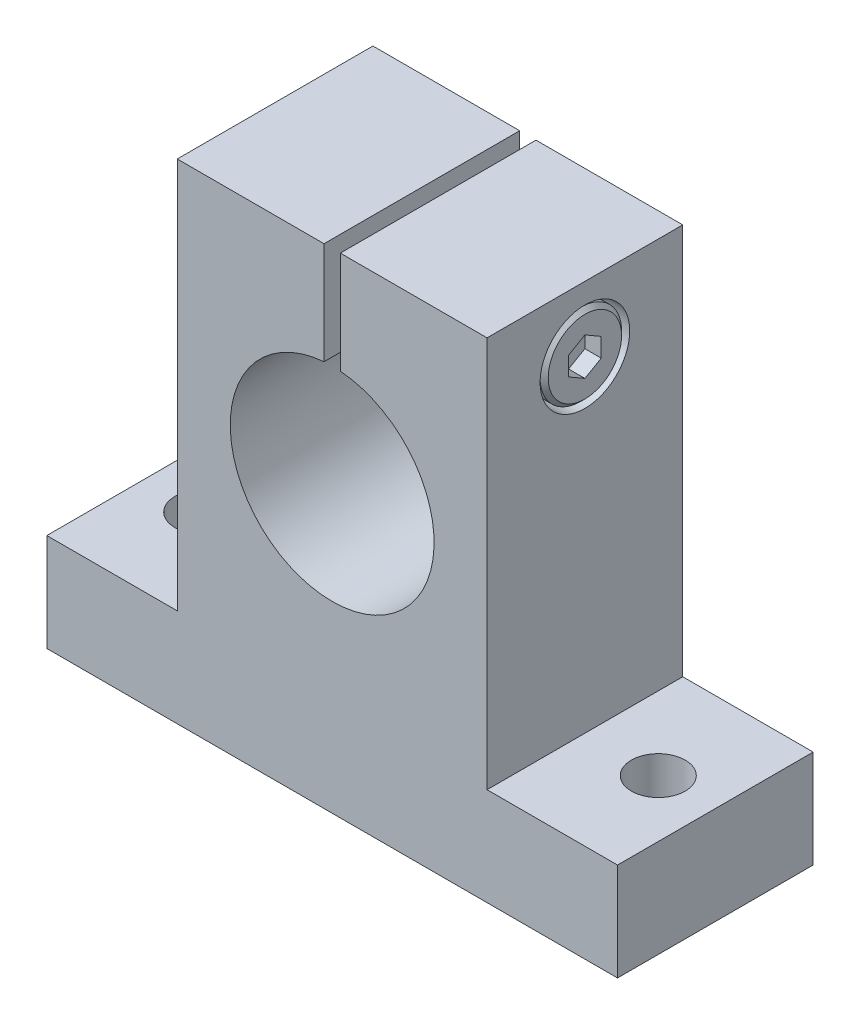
ISO-10303-21;
HEADER;
FILE_DESCRIPTION(('STEP AP214'),'2;1');
FILE_NAME('part.step','',(''),(''),'','','');
FILE_SCHEMA(('AUTOMOTIVE_DESIGN { 1 0 10303 214 1 1 1 1 }'));
ENDSEC;
DATA;
#1=APPLICATION_CONTEXT('core data for automotive mechanical design processes');
#2=APPLICATION_PROTOCOL_DEFINITION('international standard','automotive_design',2000,#1);
#3=PRODUCT_CONTEXT('',#1,'mechanical');
#4=PRODUCT('Part','Part','',(#3));
#5=PRODUCT_RELATED_PRODUCT_CATEGORY('part','',(#4));
#6=PRODUCT_DEFINITION_FORMATION('','',#4);
#7=PRODUCT_DEFINITION_CONTEXT('part definition',#1,'design');
#8=PRODUCT_DEFINITION('design','',#6,#7);
#9=PRODUCT_DEFINITION_SHAPE('','',#8);
#10=(LENGTH_UNIT() NAMED_UNIT(*) SI_UNIT(.MILLI.,.METRE.));
#11=(NAMED_UNIT(*) PLANE_ANGLE_UNIT() SI_UNIT($,.RADIAN.));
#12=(NAMED_UNIT(*) SI_UNIT($,.STERADIAN.) SOLID_ANGLE_UNIT());
#13=UNCERTAINTY_MEASURE_WITH_UNIT(LENGTH_MEASURE(1.E-05),#10,'distance_accuracy_value','');
#14=(GEOMETRIC_REPRESENTATION_CONTEXT(3) GLOBAL_UNCERTAINTY_ASSIGNED_CONTEXT((#13)) GLOBAL_UNIT_ASSIGNED_CONTEXT((#10,
#11,#12)) REPRESENTATION_CONTEXT('',''));
#15=CARTESIAN_POINT('',(0.,0.,0.));
#16=DIRECTION('',(0.,0.,1.));
#17=DIRECTION('',(1.,0.,0.));
#18=AXIS2_PLACEMENT_3D('',#15,#16,#17);
#19=CARTESIAN_POINT('',(0.,0.,-24.));
#20=DIRECTION('',(0.,0.,1.));
#21=DIRECTION('',(1.,0.,0.));
#22=AXIS2_PLACEMENT_3D('',#19,#20,#21);
#23=PLANE('',#22);
#24=DIRECTION('',(0.,1.,0.));
#25=VECTOR('',#24,1.);
#26=CARTESIAN_POINT('',(1.,0.,-24.));
#27=LINE('',#26,#25);
#28=CARTESIAN_POINT('',(1.,12.4599357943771,-24.));
#29=VERTEX_POINT('',#28);
#30=CARTESIAN_POINT('',(1.,25.,-24.));
#31=VERTEX_POINT('',#30);
#32=EDGE_CURVE('E315',#29,#31,#27,.T.);
#33=ORIENTED_EDGE('',*,*,#32,.T.);
#34=DIRECTION('',(-1.,0.,0.));
#35=VECTOR('',#34,1.);
#36=CARTESIAN_POINT('',(19.,25.,-24.));
#37=LINE('',#36,#35);
#38=CARTESIAN_POINT('',(19.,25.,-24.));
#39=VERTEX_POINT('',#38);
#40=EDGE_CURVE('E398',#39,#31,#37,.T.);
#41=ORIENTED_EDGE('',*,*,#40,.F.);
#42=DIRECTION('',(0.,1.,0.));
#43=VECTOR('',#42,1.);
#44=CARTESIAN_POINT('',(19.,-23.,-24.));
#45=LINE('',#44,#43);
#46=CARTESIAN_POINT('',(19.,-23.,-24.));
#47=VERTEX_POINT('',#46);
#48=EDGE_CURVE('E388',#47,#39,#45,.T.);
#49=ORIENTED_EDGE('',*,*,#48,.F.);
#50=DIRECTION('',(-1.,0.,0.));
#51=VECTOR('',#50,1.);
#52=CARTESIAN_POINT('',(35.,-23.,-24.));
#53=LINE('',#52,#51);
#54=CARTESIAN_POINT('',(35.,-23.,-24.));
#55=VERTEX_POINT('',#54);
#56=EDGE_CURVE('E380',#55,#47,#53,.T.);
#57=ORIENTED_EDGE('',*,*,#56,.F.);
#58=DIRECTION('',(0.,1.,0.));
#59=VECTOR('',#58,1.);
#60=CARTESIAN_POINT('',(35.,-35.,-24.));
#61=LINE('',#60,#59);
#62=CARTESIAN_POINT('',(35.,-35.,-24.));
#63=VERTEX_POINT('',#62);
#64=EDGE_CURVE('E368',#63,#55,#61,.T.);
#65=ORIENTED_EDGE('',*,*,#64,.F.);
#66=DIRECTION('',(1.,0.,0.));
#67=VECTOR('',#66,1.);
#68=CARTESIAN_POINT('',(-35.,-35.,-24.));
#69=LINE('',#68,#67);
#70=CARTESIAN_POINT('',(-35.,-35.,-24.));
#71=VERTEX_POINT('',#70);
#72=EDGE_CURVE('E10',#71,#63,#69,.T.);
#73=ORIENTED_EDGE('',*,*,#72,.F.);
#74=DIRECTION('',(0.,-1.,0.));
#75=VECTOR('',#74,1.);
#76=CARTESIAN_POINT('',(-35.,-23.,-24.));
#77=LINE('',#76,#75);
#78=CARTESIAN_POINT('',(-35.,-23.,-24.));
#79=VERTEX_POINT('',#78);
#80=EDGE_CURVE('E42',#79,#71,#77,.T.);
#81=ORIENTED_EDGE('',*,*,#80,.F.);
#82=DIRECTION('',(-1.,0.,0.));
#83=VECTOR('',#82,1.);
#84=CARTESIAN_POINT('',(-19.,-23.,-24.));
#85=LINE('',#84,#83);
#86=CARTESIAN_POINT('',(-19.,-23.,-24.));
#87=VERTEX_POINT('',#86);
#88=EDGE_CURVE('E348',#87,#79,#85,.T.);
#89=ORIENTED_EDGE('',*,*,#88,.F.);
#90=DIRECTION('',(0.,-1.,0.));
#91=VECTOR('',#90,1.);
#92=CARTESIAN_POINT('',(-19.,25.,-24.));
#93=LINE('',#92,#91);
#94=CARTESIAN_POINT('',(-19.,25.,-24.));
#95=VERTEX_POINT('',#94);
#96=EDGE_CURVE('E401',#95,#87,#93,.T.);
#97=ORIENTED_EDGE('',*,*,#96,.F.);
#98=DIRECTION('',(-1.,0.,0.));
#99=VECTOR('',#98,1.);
#100=CARTESIAN_POINT('',(19.,25.,-24.));
#101=LINE('',#100,#99);
#102=CARTESIAN_POINT('',(-1.,25.,-24.));
#103=VERTEX_POINT('',#102);
#104=EDGE_CURVE('E358',#103,#95,#101,.T.);
#105=ORIENTED_EDGE('',*,*,#104,.F.);
#106=DIRECTION('',(0.,-1.,0.));
#107=VECTOR('',#106,1.);
#108=CARTESIAN_POINT('',(-1.,12.5,-24.));
#109=LINE('',#108,#107);
#110=CARTESIAN_POINT('',(-1.,12.4599357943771,-24.));
#111=VERTEX_POINT('',#110);
#112=EDGE_CURVE('E319',#103,#111,#109,.T.);
#113=ORIENTED_EDGE('',*,*,#112,.T.);
#114=CARTESIAN_POINT('',(0.,0.,-24.));
#115=DIRECTION('',(0.,0.,1.));
#116=DIRECTION('',(1.,0.,0.));
#117=AXIS2_PLACEMENT_3D('',#114,#115,#116);
#118=CIRCLE('',#117,12.5);
#119=EDGE_CURVE('E430',#111,#29,#118,.T.);
#120=ORIENTED_EDGE('',*,*,#119,.T.);
#121=EDGE_LOOP('',(#33,#41,#49,#57,#65,#73,#81,#89,#97,#105,#113,#120));
#122=FACE_BOUND('',#121,.T.);
#123=ADVANCED_FACE('F16',(#122),#23,.F.);
#124=CARTESIAN_POINT('',(-35.,-35.,0.));
#125=DIRECTION('',(0.,-1.,0.));
#126=DIRECTION('',(0.,0.,-1.));
#127=AXIS2_PLACEMENT_3D('',#124,#125,#126);
#128=PLANE('',#127);
#129=CARTESIAN_POINT('',(28.,-35.,-12.));
#130=DIRECTION('',(0.,1.,0.));
#131=DIRECTION('',(0.,0.,-1.));
#132=AXIS2_PLACEMENT_3D('',#129,#130,#131);
#133=CIRCLE('',#132,3.3);
#134=CARTESIAN_POINT('',(28.,-35.,-8.7));
#135=VERTEX_POINT('',#134);
#136=EDGE_CURVE('E479',#135,#135,#133,.T.);
#137=ORIENTED_EDGE('',*,*,#136,.T.);
#138=EDGE_LOOP('',(#137));
#139=FACE_BOUND('',#138,.T.);
#140=CARTESIAN_POINT('',(-28.,-35.,-12.));
#141=DIRECTION('',(0.,1.,0.));
#142=DIRECTION('',(0.,0.,-1.));
#143=AXIS2_PLACEMENT_3D('',#140,#141,#142);
#144=CIRCLE('',#143,3.3);
#145=CARTESIAN_POINT('',(-28.,-35.,-8.7));
#146=VERTEX_POINT('',#145);
#147=EDGE_CURVE('E445',#146,#146,#144,.T.);
#148=ORIENTED_EDGE('',*,*,#147,.T.);
#149=EDGE_LOOP('',(#148));
#150=FACE_BOUND('',#149,.T.);
#151=ORIENTED_EDGE('',*,*,#72,.T.);
#152=DIRECTION('',(0.,0.,-1.));
#153=VECTOR('',#152,1.);
#154=CARTESIAN_POINT('',(35.,-35.,0.));
#155=LINE('',#154,#153);
#156=CARTESIAN_POINT('',(35.,-35.,0.));
#157=VERTEX_POINT('',#156);
#158=EDGE_CURVE('E375',#157,#63,#155,.T.);
#159=ORIENTED_EDGE('',*,*,#158,.F.);
#160=DIRECTION('',(1.,0.,0.));
#161=VECTOR('',#160,1.);
#162=CARTESIAN_POINT('',(-35.,-35.,0.));
#163=LINE('',#162,#161);
#164=CARTESIAN_POINT('',(-35.,-35.,0.));
#165=VERTEX_POINT('',#164);
#166=EDGE_CURVE('E340',#165,#157,#163,.T.);
#167=ORIENTED_EDGE('',*,*,#166,.F.);
#168=DIRECTION('',(0.,0.,-1.));
#169=VECTOR('',#168,1.);
#170=CARTESIAN_POINT('',(-35.,-35.,0.));
#171=LINE('',#170,#169);
#172=EDGE_CURVE('E19',#165,#71,#171,.T.);
#173=ORIENTED_EDGE('',*,*,#172,.T.);
#174=EDGE_LOOP('',(#151,#159,#167,#173));
#175=FACE_BOUND('',#174,.T.);
#176=ADVANCED_FACE('F531',(#139,#150,#175),#128,.T.);
#177=CARTESIAN_POINT('',(-35.,-23.,0.));
#178=DIRECTION('',(-1.,0.,0.));
#179=DIRECTION('',(0.,0.,1.));
#180=AXIS2_PLACEMENT_3D('',#177,#178,#179);
#181=PLANE('',#180);
#182=ORIENTED_EDGE('',*,*,#80,.T.);
#183=ORIENTED_EDGE('',*,*,#172,.F.);
#184=DIRECTION('',(0.,-1.,0.));
#185=VECTOR('',#184,1.);
#186=CARTESIAN_POINT('',(-35.,-23.,0.));
#187=LINE('',#186,#185);
#188=CARTESIAN_POINT('',(-35.,-23.,0.));
#189=VERTEX_POINT('',#188);
#190=EDGE_CURVE('E299',#189,#165,#187,.T.);
#191=ORIENTED_EDGE('',*,*,#190,.F.);
#192=DIRECTION('',(0.,0.,-1.));
#193=VECTOR('',#192,1.);
#194=CARTESIAN_POINT('',(-35.,-23.,0.));
#195=LINE('',#194,#193);
#196=EDGE_CURVE('E345',#189,#79,#195,.T.);
#197=ORIENTED_EDGE('',*,*,#196,.T.);
#198=EDGE_LOOP('',(#182,#183,#191,#197));
#199=FACE_BOUND('',#198,.T.);
#200=ADVANCED_FACE('F535',(#199),#181,.T.);
#201=CARTESIAN_POINT('',(-19.,-23.,0.));
#202=DIRECTION('',(0.,1.,0.));
#203=DIRECTION('',(1.,0.,0.));
#204=AXIS2_PLACEMENT_3D('',#201,#202,#203);
#205=PLANE('',#204);
#206=CARTESIAN_POINT('',(-28.,-23.,-12.));
#207=DIRECTION('',(0.,-1.,0.));
#208=DIRECTION('',(0.,0.,-1.));
#209=AXIS2_PLACEMENT_3D('',#206,#207,#208);
#210=CIRCLE('',#209,3.3);
#211=CARTESIAN_POINT('',(-28.,-23.,-8.7));
#212=VERTEX_POINT('',#211);
#213=EDGE_CURVE('E446',#212,#212,#210,.T.);
#214=ORIENTED_EDGE('',*,*,#213,.T.);
#215=EDGE_LOOP('',(#214));
#216=FACE_BOUND('',#215,.T.);
#217=ORIENTED_EDGE('',*,*,#88,.T.);
#218=ORIENTED_EDGE('',*,*,#196,.F.);
#219=DIRECTION('',(-1.,0.,0.));
#220=VECTOR('',#219,1.);
#221=CARTESIAN_POINT('',(-19.,-23.,0.));
#222=LINE('',#221,#220);
#223=CARTESIAN_POINT('',(-19.,-23.,0.));
#224=VERTEX_POINT('',#223);
#225=EDGE_CURVE('E295',#224,#189,#222,.T.);
#226=ORIENTED_EDGE('',*,*,#225,.F.);
#227=DIRECTION('',(0.,0.,-1.));
#228=VECTOR('',#227,1.);
#229=CARTESIAN_POINT('',(-19.,-23.,0.));
#230=LINE('',#229,#228);
#231=EDGE_CURVE('E405',#224,#87,#230,.T.);
#232=ORIENTED_EDGE('',*,*,#231,.T.);
#233=EDGE_LOOP('',(#217,#218,#226,#232));
#234=FACE_BOUND('',#233,.T.);
#235=ADVANCED_FACE('F413',(#216,#234),#205,.T.);
#236=CARTESIAN_POINT('',(-19.,25.,0.));
#237=DIRECTION('',(-1.,0.,0.));
#238=DIRECTION('',(0.,0.,1.));
#239=AXIS2_PLACEMENT_3D('',#236,#237,#238);
#240=PLANE('',#239);
#241=ORIENTED_EDGE('',*,*,#96,.T.);
#242=ORIENTED_EDGE('',*,*,#231,.F.);
#243=DIRECTION('',(0.,-1.,0.));
#244=VECTOR('',#243,1.);
#245=CARTESIAN_POINT('',(-19.,25.,0.));
#246=LINE('',#245,#244);
#247=CARTESIAN_POINT('',(-19.,25.,0.));
#248=VERTEX_POINT('',#247);
#249=EDGE_CURVE('E300',#248,#224,#246,.T.);
#250=ORIENTED_EDGE('',*,*,#249,.F.);
#251=DIRECTION('',(0.,0.,-1.));
#252=VECTOR('',#251,1.);
#253=CARTESIAN_POINT('',(-19.,25.,0.));
#254=LINE('',#253,#252);
#255=EDGE_CURVE('E362',#248,#95,#254,.T.);
#256=ORIENTED_EDGE('',*,*,#255,.T.);
#257=EDGE_LOOP('',(#241,#242,#250,#256));
#258=FACE_BOUND('',#257,.T.);
#259=ADVANCED_FACE('F418',(#258),#240,.T.);
#260=CARTESIAN_POINT('',(19.,25.,0.));
#261=DIRECTION('',(0.,1.,0.));
#262=DIRECTION('',(1.,0.,0.));
#263=AXIS2_PLACEMENT_3D('',#260,#261,#262);
#264=PLANE('',#263);
#265=DIRECTION('',(0.,0.,1.));
#266=VECTOR('',#265,1.);
#267=CARTESIAN_POINT('',(1.,25.,0.));
#268=LINE('',#267,#266);
#269=CARTESIAN_POINT('',(1.,25.,0.));
#270=VERTEX_POINT('',#269);
#271=EDGE_CURVE('E311',#31,#270,#268,.T.);
#272=ORIENTED_EDGE('',*,*,#271,.T.);
#273=DIRECTION('',(-1.,0.,0.));
#274=VECTOR('',#273,1.);
#275=CARTESIAN_POINT('',(19.,25.,0.));
#276=LINE('',#275,#274);
#277=CARTESIAN_POINT('',(19.,25.,0.));
#278=VERTEX_POINT('',#277);
#279=EDGE_CURVE('E357',#278,#270,#276,.T.);
#280=ORIENTED_EDGE('',*,*,#279,.F.);
#281=DIRECTION('',(0.,0.,-1.));
#282=VECTOR('',#281,1.);
#283=CARTESIAN_POINT('',(19.,25.,0.));
#284=LINE('',#283,#282);
#285=EDGE_CURVE('E392',#278,#39,#284,.T.);
#286=ORIENTED_EDGE('',*,*,#285,.T.);
#287=ORIENTED_EDGE('',*,*,#40,.T.);
#288=EDGE_LOOP('',(#272,#280,#286,#287));
#289=FACE_BOUND('',#288,.T.);
#290=ADVANCED_FACE('F549',(#289),#264,.T.);
#291=CARTESIAN_POINT('',(19.,-23.,0.));
#292=DIRECTION('',(1.,0.,0.));
#293=DIRECTION('',(0.,1.,0.));
#294=AXIS2_PLACEMENT_3D('',#291,#292,#293);
#295=PLANE('',#294);
#296=CARTESIAN_POINT('',(19.,17.,-12.));
#297=DIRECTION('',(-1.,0.,0.));
#298=DIRECTION('',(0.,0.,-1.));
#299=AXIS2_PLACEMENT_3D('',#296,#297,#298);
#300=CIRCLE('',#299,5.5);
#301=CARTESIAN_POINT('',(19.,17.,-6.5));
#302=VERTEX_POINT('',#301);
#303=EDGE_CURVE('E500',#302,#302,#300,.T.);
#304=ORIENTED_EDGE('',*,*,#303,.T.);
#305=EDGE_LOOP('',(#304));
#306=FACE_BOUND('',#305,.T.);
#307=ORIENTED_EDGE('',*,*,#48,.T.);
#308=ORIENTED_EDGE('',*,*,#285,.F.);
#309=DIRECTION('',(0.,1.,0.));
#310=VECTOR('',#309,1.);
#311=CARTESIAN_POINT('',(19.,-23.,0.));
#312=LINE('',#311,#310);
#313=CARTESIAN_POINT('',(19.,-23.,0.));
#314=VERTEX_POINT('',#313);
#315=EDGE_CURVE('E353',#314,#278,#312,.T.);
#316=ORIENTED_EDGE('',*,*,#315,.F.);
#317=DIRECTION('',(0.,0.,-1.));
#318=VECTOR('',#317,1.);
#319=CARTESIAN_POINT('',(19.,-23.,0.));
#320=LINE('',#319,#318);
#321=EDGE_CURVE('E384',#314,#47,#320,.T.);
#322=ORIENTED_EDGE('',*,*,#321,.T.);
#323=EDGE_LOOP('',(#307,#308,#316,#322));
#324=FACE_BOUND('',#323,.T.);
#325=ADVANCED_FACE('F550',(#306,#324),#295,.T.);
#326=CARTESIAN_POINT('',(35.,-23.,0.));
#327=DIRECTION('',(0.,1.,0.));
#328=DIRECTION('',(1.,0.,0.));
#329=AXIS2_PLACEMENT_3D('',#326,#327,#328);
#330=PLANE('',#329);
#331=CARTESIAN_POINT('',(28.,-23.,-12.));
#332=DIRECTION('',(0.,-1.,0.));
#333=DIRECTION('',(0.,0.,-1.));
#334=AXIS2_PLACEMENT_3D('',#331,#332,#333);
#335=CIRCLE('',#334,3.3);
#336=CARTESIAN_POINT('',(28.,-23.,-8.7));
#337=VERTEX_POINT('',#336);
#338=EDGE_CURVE('E468',#337,#337,#335,.T.);
#339=ORIENTED_EDGE('',*,*,#338,.T.);
#340=EDGE_LOOP('',(#339));
#341=FACE_BOUND('',#340,.T.);
#342=ORIENTED_EDGE('',*,*,#56,.T.);
#343=ORIENTED_EDGE('',*,*,#321,.F.);
#344=DIRECTION('',(-1.,0.,0.));
#345=VECTOR('',#344,1.);
#346=CARTESIAN_POINT('',(35.,-23.,0.));
#347=LINE('',#346,#345);
#348=CARTESIAN_POINT('',(35.,-23.,0.));
#349=VERTEX_POINT('',#348);
#350=EDGE_CURVE('E352',#349,#314,#347,.T.);
#351=ORIENTED_EDGE('',*,*,#350,.F.);
#352=DIRECTION('',(0.,0.,-1.));
#353=VECTOR('',#352,1.);
#354=CARTESIAN_POINT('',(35.,-23.,0.));
#355=LINE('',#354,#353);
#356=EDGE_CURVE('E372',#349,#55,#355,.T.);
#357=ORIENTED_EDGE('',*,*,#356,.T.);
#358=EDGE_LOOP('',(#342,#343,#351,#357));
#359=FACE_BOUND('',#358,.T.);
#360=ADVANCED_FACE('F553',(#341,#359),#330,.T.);
#361=CARTESIAN_POINT('',(35.,-35.,0.));
#362=DIRECTION('',(1.,0.,0.));
#363=DIRECTION('',(0.,1.,0.));
#364=AXIS2_PLACEMENT_3D('',#361,#362,#363);
#365=PLANE('',#364);
#366=ORIENTED_EDGE('',*,*,#64,.T.);
#367=ORIENTED_EDGE('',*,*,#356,.F.);
#368=DIRECTION('',(0.,1.,0.));
#369=VECTOR('',#368,1.);
#370=CARTESIAN_POINT('',(35.,-35.,0.));
#371=LINE('',#370,#369);
#372=EDGE_CURVE('E344',#157,#349,#371,.T.);
#373=ORIENTED_EDGE('',*,*,#372,.F.);
#374=ORIENTED_EDGE('',*,*,#158,.T.);
#375=EDGE_LOOP('',(#366,#367,#373,#374));
#376=FACE_BOUND('',#375,.T.);
#377=ADVANCED_FACE('F555',(#376),#365,.T.);
#378=CARTESIAN_POINT('',(19.,25.,0.));
#379=DIRECTION('',(0.,1.,0.));
#380=DIRECTION('',(1.,0.,0.));
#381=AXIS2_PLACEMENT_3D('',#378,#379,#380);
#382=PLANE('',#381);
#383=DIRECTION('',(0.,0.,-1.));
#384=VECTOR('',#383,1.);
#385=CARTESIAN_POINT('',(-1.,25.,0.));
#386=LINE('',#385,#384);
#387=CARTESIAN_POINT('',(-1.,25.,0.));
#388=VERTEX_POINT('',#387);
#389=EDGE_CURVE('E322',#388,#103,#386,.T.);
#390=ORIENTED_EDGE('',*,*,#389,.T.);
#391=ORIENTED_EDGE('',*,*,#104,.T.);
#392=ORIENTED_EDGE('',*,*,#255,.F.);
#393=DIRECTION('',(-1.,0.,0.));
#394=VECTOR('',#393,1.);
#395=CARTESIAN_POINT('',(19.,25.,0.));
#396=LINE('',#395,#394);
#397=EDGE_CURVE('E327',#388,#248,#396,.T.);
#398=ORIENTED_EDGE('',*,*,#397,.F.);
#399=EDGE_LOOP('',(#390,#391,#392,#398));
#400=FACE_BOUND('',#399,.T.);
#401=ADVANCED_FACE('F420',(#400),#382,.T.);
#402=CARTESIAN_POINT('',(0.,0.,0.));
#403=DIRECTION('',(0.,0.,1.));
#404=DIRECTION('',(1.,0.,0.));
#405=AXIS2_PLACEMENT_3D('',#402,#403,#404);
#406=PLANE('',#405);
#407=DIRECTION('',(0.,-1.,0.));
#408=VECTOR('',#407,1.);
#409=CARTESIAN_POINT('',(1.,0.,0.));
#410=LINE('',#409,#408);
#411=CARTESIAN_POINT('',(1.,12.4599357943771,0.));
#412=VERTEX_POINT('',#411);
#413=EDGE_CURVE('E308',#270,#412,#410,.T.);
#414=ORIENTED_EDGE('',*,*,#413,.T.);
#415=CARTESIAN_POINT('',(0.,0.,0.));
#416=DIRECTION('',(0.,0.,-1.));
#417=DIRECTION('',(1.,0.,0.));
#418=AXIS2_PLACEMENT_3D('',#415,#416,#417);
#419=CIRCLE('',#418,12.5);
#420=CARTESIAN_POINT('',(-1.,12.4599357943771,0.));
#421=VERTEX_POINT('',#420);
#422=EDGE_CURVE('E439',#412,#421,#419,.T.);
#423=ORIENTED_EDGE('',*,*,#422,.T.);
#424=DIRECTION('',(0.,1.,0.));
#425=VECTOR('',#424,1.);
#426=CARTESIAN_POINT('',(-1.,12.5,0.));
#427=LINE('',#426,#425);
#428=EDGE_CURVE('E323',#421,#388,#427,.T.);
#429=ORIENTED_EDGE('',*,*,#428,.T.);
#430=ORIENTED_EDGE('',*,*,#397,.T.);
#431=ORIENTED_EDGE('',*,*,#249,.T.);
#432=ORIENTED_EDGE('',*,*,#225,.T.);
#433=ORIENTED_EDGE('',*,*,#190,.T.);
#434=ORIENTED_EDGE('',*,*,#166,.T.);
#435=ORIENTED_EDGE('',*,*,#372,.T.);
#436=ORIENTED_EDGE('',*,*,#350,.T.);
#437=ORIENTED_EDGE('',*,*,#315,.T.);
#438=ORIENTED_EDGE('',*,*,#279,.T.);
#439=EDGE_LOOP('',(#414,#423,#429,#430,#431,#432,#433,#434,#435,#436,#437,#438));
#440=FACE_BOUND('',#439,.T.);
#441=ADVANCED_FACE('F561',(#440),#406,.T.);
#442=CARTESIAN_POINT('',(-1.,25.,0.));
#443=DIRECTION('',(-1.,0.,0.));
#444=DIRECTION('',(0.,0.,1.));
#445=AXIS2_PLACEMENT_3D('',#442,#443,#444);
#446=PLANE('',#445);
#447=CARTESIAN_POINT('',(-1.,17.,-12.));
#448=DIRECTION('',(-1.,0.,0.));
#449=DIRECTION('',(0.,1.,0.));
#450=AXIS2_PLACEMENT_3D('',#447,#448,#449);
#451=CIRCLE('',#450,3.);
#452=CARTESIAN_POINT('',(-1.,14.,-12.));
#453=VERTEX_POINT('',#452);
#454=EDGE_CURVE('E458',#453,#453,#451,.T.);
#455=ORIENTED_EDGE('',*,*,#454,.T.);
#456=EDGE_LOOP('',(#455));
#457=FACE_BOUND('',#456,.T.);
#458=DIRECTION('',(0.,0.,1.));
#459=VECTOR('',#458,1.);
#460=CARTESIAN_POINT('',(-1.,12.4599357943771,-12.));
#461=LINE('',#460,#459);
#462=EDGE_CURVE('E427',#111,#421,#461,.T.);
#463=ORIENTED_EDGE('',*,*,#462,.F.);
#464=ORIENTED_EDGE('',*,*,#112,.F.);
#465=ORIENTED_EDGE('',*,*,#389,.F.);
#466=ORIENTED_EDGE('',*,*,#428,.F.);
#467=EDGE_LOOP('',(#463,#464,#465,#466));
#468=FACE_BOUND('',#467,.T.);
#469=ADVANCED_FACE('F425',(#457,#468),#446,.F.);
#470=CARTESIAN_POINT('',(1.,0.,0.));
#471=DIRECTION('',(1.,0.,0.));
#472=DIRECTION('',(0.,1.,0.));
#473=AXIS2_PLACEMENT_3D('',#470,#471,#472);
#474=PLANE('',#473);
#475=CARTESIAN_POINT('',(1.,17.,-12.));
#476=DIRECTION('',(1.,0.,0.));
#477=DIRECTION('',(0.,1.,0.));
#478=AXIS2_PLACEMENT_3D('',#475,#476,#477);
#479=CIRCLE('',#478,3.);
#480=CARTESIAN_POINT('',(1.,14.,-12.));
#481=VERTEX_POINT('',#480);
#482=EDGE_CURVE('E487',#481,#481,#479,.T.);
#483=ORIENTED_EDGE('',*,*,#482,.T.);
#484=EDGE_LOOP('',(#483));
#485=FACE_BOUND('',#484,.T.);
#486=DIRECTION('',(0.,0.,-1.));
#487=VECTOR('',#486,1.);
#488=CARTESIAN_POINT('',(1.,12.4599357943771,-12.));
#489=LINE('',#488,#487);
#490=EDGE_CURVE('E465',#412,#29,#489,.T.);
#491=ORIENTED_EDGE('',*,*,#490,.F.);
#492=ORIENTED_EDGE('',*,*,#413,.F.);
#493=ORIENTED_EDGE('',*,*,#271,.F.);
#494=ORIENTED_EDGE('',*,*,#32,.F.);
#495=EDGE_LOOP('',(#491,#492,#493,#494));
#496=FACE_BOUND('',#495,.T.);
#497=ADVANCED_FACE('F567',(#485,#496),#474,.F.);
#498=CARTESIAN_POINT('',(15.,0.,0.));
#499=DIRECTION('',(1.,0.,0.));
#500=DIRECTION('',(0.,1.,0.));
#501=AXIS2_PLACEMENT_3D('',#498,#499,#500);
#502=PLANE('',#501);
#503=CARTESIAN_POINT('',(15.,17.,-12.));
#504=DIRECTION('',(-1.,0.,0.));
#505=DIRECTION('',(0.,1.,0.));
#506=AXIS2_PLACEMENT_3D('',#503,#504,#505);
#507=CIRCLE('',#506,5.);
#508=CARTESIAN_POINT('',(15.,12.,-12.));
#509=VERTEX_POINT('',#508);
#510=EDGE_CURVE('E242',#509,#509,#507,.T.);
#511=ORIENTED_EDGE('',*,*,#510,.T.);
#512=EDGE_LOOP('',(#511));
#513=FACE_BOUND('',#512,.T.);
#514=CARTESIAN_POINT('',(15.,17.,-12.));
#515=DIRECTION('',(1.,0.,0.));
#516=DIRECTION('',(0.,0.,-1.));
#517=AXIS2_PLACEMENT_3D('',#514,#515,#516);
#518=CIRCLE('',#517,5.5);
#519=CARTESIAN_POINT('',(15.,17.,-6.5));
#520=VERTEX_POINT('',#519);
#521=EDGE_CURVE('E453',#520,#520,#518,.T.);
#522=ORIENTED_EDGE('',*,*,#521,.T.);
#523=EDGE_LOOP('',(#522));
#524=FACE_BOUND('',#523,.T.);
#525=ADVANCED_FACE('F512',(#513,#524),#502,.T.);
#526=CARTESIAN_POINT('',(19.,19.25,-12.));
#527=DIRECTION('',(1.,0.,0.));
#528=DIRECTION('',(0.,1.,0.));
#529=AXIS2_PLACEMENT_3D('',#526,#527,#528);
#530=PLANE('',#529);
#531=DIRECTION('',(0.,0.5,0.866025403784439));
#532=VECTOR('',#531,1.);
#533=CARTESIAN_POINT('',(19.,15.8378743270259,-10.0128607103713));
#534=LINE('',#533,#532);
#535=CARTESIAN_POINT('',(19.,14.6905989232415,-12.));
#536=VERTEX_POINT('',#535);
#537=CARTESIAN_POINT('',(19.,15.8452994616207,-10.));
#538=VERTEX_POINT('',#537);
#539=EDGE_CURVE('E246',#536,#538,#534,.T.);
#540=ORIENTED_EDGE('',*,*,#539,.T.);
#541=DIRECTION('',(0.,1.,0.));
#542=VECTOR('',#541,1.);
#543=CARTESIAN_POINT('',(19.,18.7023502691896,-10.));
#544=LINE('',#543,#542);
#545=CARTESIAN_POINT('',(19.,18.1547005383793,-10.));
#546=VERTEX_POINT('',#545);
#547=EDGE_CURVE('E307',#538,#546,#544,.T.);
#548=ORIENTED_EDGE('',*,*,#547,.T.);
#549=DIRECTION('',(0.,0.5,-0.866025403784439));
#550=VECTOR('',#549,1.);
#551=CARTESIAN_POINT('',(19.,19.3019759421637,-11.9871392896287));
#552=LINE('',#551,#550);
#553=CARTESIAN_POINT('',(19.,19.3094010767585,-12.));
#554=VERTEX_POINT('',#553);
#555=EDGE_CURVE('E291',#546,#554,#552,.T.);
#556=ORIENTED_EDGE('',*,*,#555,.T.);
#557=DIRECTION('',(0.,-0.5,-0.866025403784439));
#558=VECTOR('',#557,1.);
#559=CARTESIAN_POINT('',(19.,18.7246256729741,-13.0128607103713));
#560=LINE('',#559,#558);
#561=CARTESIAN_POINT('',(19.,18.1547005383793,-14.));
#562=VERTEX_POINT('',#561);
#563=EDGE_CURVE('E251',#554,#562,#560,.T.);
#564=ORIENTED_EDGE('',*,*,#563,.T.);
#565=DIRECTION('',(0.,-1.,0.));
#566=VECTOR('',#565,1.);
#567=CARTESIAN_POINT('',(19.,17.5476497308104,-14.));
#568=LINE('',#567,#566);
#569=CARTESIAN_POINT('',(19.,15.8452994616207,-14.));
#570=VERTEX_POINT('',#569);
#571=EDGE_CURVE('E274',#562,#570,#568,.T.);
#572=ORIENTED_EDGE('',*,*,#571,.T.);
#573=DIRECTION('',(0.,-0.5,0.866025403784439));
#574=VECTOR('',#573,1.);
#575=CARTESIAN_POINT('',(19.,15.2605240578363,-12.9871392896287));
#576=LINE('',#575,#574);
#577=EDGE_CURVE('E263',#570,#536,#576,.T.);
#578=ORIENTED_EDGE('',*,*,#577,.T.);
#579=EDGE_LOOP('',(#540,#548,#556,#564,#572,#578));
#580=FACE_BOUND('',#579,.T.);
#581=CARTESIAN_POINT('',(19.,17.,-12.));
#582=DIRECTION('',(-1.,0.,0.));
#583=DIRECTION('',(0.,1.,0.));
#584=AXIS2_PLACEMENT_3D('',#581,#582,#583);
#585=CIRCLE('',#584,4.5);
#586=CARTESIAN_POINT('',(19.,12.5,-12.));
#587=VERTEX_POINT('',#586);
#588=EDGE_CURVE('E225',#587,#587,#585,.T.);
#589=ORIENTED_EDGE('',*,*,#588,.F.);
#590=EDGE_LOOP('',(#589));
#591=FACE_BOUND('',#590,.T.);
#592=ADVANCED_FACE('F579',(#580,#591),#530,.T.);
#593=CARTESIAN_POINT('',(17.,0.,0.));
#594=DIRECTION('',(1.,0.,0.));
#595=DIRECTION('',(0.,1.,0.));
#596=AXIS2_PLACEMENT_3D('',#593,#594,#595);
#597=PLANE('',#596);
#598=DIRECTION('',(0.,-0.5,-0.866025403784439));
#599=VECTOR('',#598,1.);
#600=CARTESIAN_POINT('',(17.,15.8452994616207,-10.));
#601=LINE('',#600,#599);
#602=CARTESIAN_POINT('',(17.,15.8452994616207,-10.));
#603=VERTEX_POINT('',#602);
#604=CARTESIAN_POINT('',(17.,14.6905989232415,-12.));
#605=VERTEX_POINT('',#604);
#606=EDGE_CURVE('E232',#603,#605,#601,.T.);
#607=ORIENTED_EDGE('',*,*,#606,.T.);
#608=DIRECTION('',(0.,0.5,-0.866025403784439));
#609=VECTOR('',#608,1.);
#610=CARTESIAN_POINT('',(17.,14.6905989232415,-12.));
#611=LINE('',#610,#609);
#612=CARTESIAN_POINT('',(17.,15.8452994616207,-14.));
#613=VERTEX_POINT('',#612);
#614=EDGE_CURVE('E259',#605,#613,#611,.T.);
#615=ORIENTED_EDGE('',*,*,#614,.T.);
#616=DIRECTION('',(0.,1.,0.));
#617=VECTOR('',#616,1.);
#618=CARTESIAN_POINT('',(17.,15.8452994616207,-14.));
#619=LINE('',#618,#617);
#620=CARTESIAN_POINT('',(17.,18.1547005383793,-14.));
#621=VERTEX_POINT('',#620);
#622=EDGE_CURVE('E270',#613,#621,#619,.T.);
#623=ORIENTED_EDGE('',*,*,#622,.T.);
#624=DIRECTION('',(0.,0.5,0.866025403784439));
#625=VECTOR('',#624,1.);
#626=CARTESIAN_POINT('',(17.,18.1547005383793,-14.));
#627=LINE('',#626,#625);
#628=CARTESIAN_POINT('',(17.,19.3094010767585,-12.));
#629=VERTEX_POINT('',#628);
#630=EDGE_CURVE('E255',#621,#629,#627,.T.);
#631=ORIENTED_EDGE('',*,*,#630,.T.);
#632=DIRECTION('',(0.,-0.5,0.866025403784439));
#633=VECTOR('',#632,1.);
#634=CARTESIAN_POINT('',(17.,19.3094010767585,-12.));
#635=LINE('',#634,#633);
#636=CARTESIAN_POINT('',(17.,18.1547005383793,-10.));
#637=VERTEX_POINT('',#636);
#638=EDGE_CURVE('E287',#629,#637,#635,.T.);
#639=ORIENTED_EDGE('',*,*,#638,.T.);
#640=DIRECTION('',(0.,-1.,0.));
#641=VECTOR('',#640,1.);
#642=CARTESIAN_POINT('',(17.,18.1547005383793,-10.));
#643=LINE('',#642,#641);
#644=EDGE_CURVE('E304',#637,#603,#643,.T.);
#645=ORIENTED_EDGE('',*,*,#644,.T.);
#646=EDGE_LOOP('',(#607,#615,#623,#631,#639,#645));
#647=FACE_BOUND('',#646,.T.);
#648=ADVANCED_FACE('F575',(#647),#597,.T.);
#649=CARTESIAN_POINT('',(19.,18.1547005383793,-10.));
#650=DIRECTION('',(0.,0.,1.));
#651=DIRECTION('',(1.,0.,0.));
#652=AXIS2_PLACEMENT_3D('',#649,#650,#651);
#653=PLANE('',#652);
#654=ORIENTED_EDGE('',*,*,#644,.F.);
#655=DIRECTION('',(-1.,0.,0.));
#656=VECTOR('',#655,1.);
#657=CARTESIAN_POINT('',(19.,18.1547005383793,-10.));
#658=LINE('',#657,#656);
#659=EDGE_CURVE('E294',#546,#637,#658,.T.);
#660=ORIENTED_EDGE('',*,*,#659,.F.);
#661=ORIENTED_EDGE('',*,*,#547,.F.);
#662=DIRECTION('',(-1.,0.,0.));
#663=VECTOR('',#662,1.);
#664=CARTESIAN_POINT('',(19.,15.8452994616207,-10.));
#665=LINE('',#664,#663);
#666=EDGE_CURVE('E240',#538,#603,#665,.T.);
#667=ORIENTED_EDGE('',*,*,#666,.T.);
#668=EDGE_LOOP('',(#654,#660,#661,#667));
#669=FACE_BOUND('',#668,.T.);
#670=ADVANCED_FACE('F578',(#669),#653,.F.);
#671=CARTESIAN_POINT('',(19.,19.3094010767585,-12.));
#672=DIRECTION('',(0.,0.866025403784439,0.5));
#673=DIRECTION('',(1.,0.,0.));
#674=AXIS2_PLACEMENT_3D('',#671,#672,#673);
#675=PLANE('',#674);
#676=ORIENTED_EDGE('',*,*,#638,.F.);
#677=DIRECTION('',(-1.,0.,0.));
#678=VECTOR('',#677,1.);
#679=CARTESIAN_POINT('',(19.,19.3094010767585,-12.));
#680=LINE('',#679,#678);
#681=EDGE_CURVE('E254',#554,#629,#680,.T.);
#682=ORIENTED_EDGE('',*,*,#681,.F.);
#683=ORIENTED_EDGE('',*,*,#555,.F.);
#684=ORIENTED_EDGE('',*,*,#659,.T.);
#685=EDGE_LOOP('',(#676,#682,#683,#684));
#686=FACE_BOUND('',#685,.T.);
#687=ADVANCED_FACE('F586',(#686),#675,.F.);
#688=CARTESIAN_POINT('',(19.,18.1547005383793,-14.));
#689=DIRECTION('',(0.,0.866025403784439,-0.5));
#690=DIRECTION('',(-1.,0.,0.));
#691=AXIS2_PLACEMENT_3D('',#688,#689,#690);
#692=PLANE('',#691);
#693=ORIENTED_EDGE('',*,*,#630,.F.);
#694=DIRECTION('',(-1.,0.,0.));
#695=VECTOR('',#694,1.);
#696=CARTESIAN_POINT('',(19.,18.1547005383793,-14.));
#697=LINE('',#696,#695);
#698=EDGE_CURVE('E277',#562,#621,#697,.T.);
#699=ORIENTED_EDGE('',*,*,#698,.F.);
#700=ORIENTED_EDGE('',*,*,#563,.F.);
#701=ORIENTED_EDGE('',*,*,#681,.T.);
#702=EDGE_LOOP('',(#693,#699,#700,#701));
#703=FACE_BOUND('',#702,.T.);
#704=ADVANCED_FACE('F589',(#703),#692,.F.);
#705=CARTESIAN_POINT('',(19.,15.8452994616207,-14.));
#706=DIRECTION('',(0.,0.,-1.));
#707=DIRECTION('',(0.,-1.,0.));
#708=AXIS2_PLACEMENT_3D('',#705,#706,#707);
#709=PLANE('',#708);
#710=ORIENTED_EDGE('',*,*,#622,.F.);
#711=DIRECTION('',(-1.,0.,0.));
#712=VECTOR('',#711,1.);
#713=CARTESIAN_POINT('',(19.,15.8452994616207,-14.));
#714=LINE('',#713,#712);
#715=EDGE_CURVE('E266',#570,#613,#714,.T.);
#716=ORIENTED_EDGE('',*,*,#715,.F.);
#717=ORIENTED_EDGE('',*,*,#571,.F.);
#718=ORIENTED_EDGE('',*,*,#698,.T.);
#719=EDGE_LOOP('',(#710,#716,#717,#718));
#720=FACE_BOUND('',#719,.T.);
#721=ADVANCED_FACE('F591',(#720),#709,.F.);
#722=CARTESIAN_POINT('',(19.,14.6905989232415,-12.));
#723=DIRECTION('',(0.,-0.866025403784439,-0.5));
#724=DIRECTION('',(0.,0.5,-0.866025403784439));
#725=AXIS2_PLACEMENT_3D('',#722,#723,#724);
#726=PLANE('',#725);
#727=ORIENTED_EDGE('',*,*,#614,.F.);
#728=DIRECTION('',(-1.,0.,0.));
#729=VECTOR('',#728,1.);
#730=CARTESIAN_POINT('',(19.,14.6905989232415,-12.));
#731=LINE('',#730,#729);
#732=EDGE_CURVE('E250',#536,#605,#731,.T.);
#733=ORIENTED_EDGE('',*,*,#732,.F.);
#734=ORIENTED_EDGE('',*,*,#577,.F.);
#735=ORIENTED_EDGE('',*,*,#715,.T.);
#736=EDGE_LOOP('',(#727,#733,#734,#735));
#737=FACE_BOUND('',#736,.T.);
#738=ADVANCED_FACE('F594',(#737),#726,.F.);
#739=CARTESIAN_POINT('',(19.,15.8452994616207,-10.));
#740=DIRECTION('',(0.,-0.866025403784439,0.5));
#741=DIRECTION('',(-1.,0.,0.));
#742=AXIS2_PLACEMENT_3D('',#739,#740,#741);
#743=PLANE('',#742);
#744=ORIENTED_EDGE('',*,*,#606,.F.);
#745=ORIENTED_EDGE('',*,*,#666,.F.);
#746=ORIENTED_EDGE('',*,*,#539,.F.);
#747=ORIENTED_EDGE('',*,*,#732,.T.);
#748=EDGE_LOOP('',(#744,#745,#746,#747));
#749=FACE_BOUND('',#748,.T.);
#750=ADVANCED_FACE('F527',(#749),#743,.F.);
#751=CARTESIAN_POINT('',(18.75,17.,-12.));
#752=DIRECTION('',(-1.,0.,0.));
#753=DIRECTION('',(0.,1.,0.));
#754=AXIS2_PLACEMENT_3D('',#751,#752,#753);
#755=CONICAL_SURFACE('',#754,4.75,0.785398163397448);
#756=CARTESIAN_POINT('',(18.5,17.,-12.));
#757=DIRECTION('',(-1.,0.,0.));
#758=DIRECTION('',(0.,1.,0.));
#759=AXIS2_PLACEMENT_3D('',#756,#757,#758);
#760=CIRCLE('',#759,5.);
#761=CARTESIAN_POINT('',(18.5,12.,-12.));
#762=VERTEX_POINT('',#761);
#763=EDGE_CURVE('E452',#762,#762,#760,.T.);
#764=ORIENTED_EDGE('',*,*,#763,.F.);
#765=DIRECTION('',(0.707106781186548,0.707106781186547,0.));
#766=VECTOR('',#765,1.);
#767=CARTESIAN_POINT('',(18.75,12.25,-12.));
#768=LINE('',#767,#766);
#769=EDGE_CURVE('E228',#762,#587,#768,.T.);
#770=ORIENTED_EDGE('',*,*,#769,.T.);
#771=ORIENTED_EDGE('',*,*,#588,.T.);
#772=ORIENTED_EDGE('',*,*,#769,.F.);
#773=EDGE_LOOP('',(#764,#770,#771,#772));
#774=FACE_BOUND('',#773,.T.);
#775=ADVANCED_FACE('F227',(#774),#755,.T.);
#776=CARTESIAN_POINT('',(16.75,17.,-12.));
#777=DIRECTION('',(1.,0.,0.));
#778=DIRECTION('',(0.,1.,0.));
#779=AXIS2_PLACEMENT_3D('',#776,#777,#778);
#780=CYLINDRICAL_SURFACE('',#779,5.);
#781=ORIENTED_EDGE('',*,*,#763,.T.);
#782=DIRECTION('',(-1.,0.,0.));
#783=VECTOR('',#782,1.);
#784=CARTESIAN_POINT('',(16.75,12.,-12.));
#785=LINE('',#784,#783);
#786=EDGE_CURVE('E448',#762,#509,#785,.T.);
#787=ORIENTED_EDGE('',*,*,#786,.T.);
#788=ORIENTED_EDGE('',*,*,#510,.F.);
#789=ORIENTED_EDGE('',*,*,#786,.F.);
#790=EDGE_LOOP('',(#781,#787,#788,#789));
#791=FACE_BOUND('',#790,.T.);
#792=ADVANCED_FACE('F515',(#791),#780,.T.);
#793=CARTESIAN_POINT('',(19.,17.,-12.));
#794=DIRECTION('',(1.,0.,0.));
#795=DIRECTION('',(0.,0.,-1.));
#796=AXIS2_PLACEMENT_3D('',#793,#794,#795);
#797=CYLINDRICAL_SURFACE('',#796,5.5);
#798=ORIENTED_EDGE('',*,*,#521,.F.);
#799=DIRECTION('',(1.,0.,0.));
#800=VECTOR('',#799,1.);
#801=CARTESIAN_POINT('',(19.,17.,-6.5));
#802=LINE('',#801,#800);
#803=EDGE_CURVE('E457',#520,#302,#802,.T.);
#804=ORIENTED_EDGE('',*,*,#803,.T.);
#805=ORIENTED_EDGE('',*,*,#303,.F.);
#806=ORIENTED_EDGE('',*,*,#803,.F.);
#807=EDGE_LOOP('',(#798,#804,#805,#806));
#808=FACE_BOUND('',#807,.T.);
#809=ADVANCED_FACE('F517',(#808),#797,.F.);
#810=CARTESIAN_POINT('',(0.,17.,-12.));
#811=DIRECTION('',(1.,0.,0.));
#812=DIRECTION('',(0.,1.,0.));
#813=AXIS2_PLACEMENT_3D('',#810,#811,#812);
#814=CYLINDRICAL_SURFACE('',#813,3.);
#815=ORIENTED_EDGE('',*,*,#482,.F.);
#816=DIRECTION('',(-1.,0.,0.));
#817=VECTOR('',#816,1.);
#818=CARTESIAN_POINT('',(0.,14.,-12.));
#819=LINE('',#818,#817);
#820=EDGE_CURVE('E461',#481,#453,#819,.T.);
#821=ORIENTED_EDGE('',*,*,#820,.T.);
#822=ORIENTED_EDGE('',*,*,#454,.F.);
#823=ORIENTED_EDGE('',*,*,#820,.F.);
#824=EDGE_LOOP('',(#815,#821,#822,#823));
#825=FACE_BOUND('',#824,.T.);
#826=ADVANCED_FACE('F524',(#825),#814,.T.);
#827=CARTESIAN_POINT('',(-28.,-29.,-12.));
#828=DIRECTION('',(0.,-1.,0.));
#829=DIRECTION('',(0.,0.,-1.));
#830=AXIS2_PLACEMENT_3D('',#827,#828,#829);
#831=CYLINDRICAL_SURFACE('',#830,3.3);
#832=ORIENTED_EDGE('',*,*,#213,.F.);
#833=DIRECTION('',(0.,-1.,0.));
#834=VECTOR('',#833,1.);
#835=CARTESIAN_POINT('',(-28.,-29.,-8.7));
#836=LINE('',#835,#834);
#837=EDGE_CURVE('E442',#212,#146,#836,.T.);
#838=ORIENTED_EDGE('',*,*,#837,.T.);
#839=ORIENTED_EDGE('',*,*,#147,.F.);
#840=ORIENTED_EDGE('',*,*,#837,.F.);
#841=EDGE_LOOP('',(#832,#838,#839,#840));
#842=FACE_BOUND('',#841,.T.);
#843=ADVANCED_FACE('F631',(#842),#831,.F.);
#844=CARTESIAN_POINT('',(28.,-29.,-12.));
#845=DIRECTION('',(0.,-1.,0.));
#846=DIRECTION('',(0.,0.,-1.));
#847=AXIS2_PLACEMENT_3D('',#844,#845,#846);
#848=CYLINDRICAL_SURFACE('',#847,3.3);
#849=ORIENTED_EDGE('',*,*,#338,.F.);
#850=DIRECTION('',(0.,-1.,0.));
#851=VECTOR('',#850,1.);
#852=CARTESIAN_POINT('',(28.,-29.,-8.7));
#853=LINE('',#852,#851);
#854=EDGE_CURVE('E472',#337,#135,#853,.T.);
#855=ORIENTED_EDGE('',*,*,#854,.T.);
#856=ORIENTED_EDGE('',*,*,#136,.F.);
#857=ORIENTED_EDGE('',*,*,#854,.F.);
#858=EDGE_LOOP('',(#849,#855,#856,#857));
#859=FACE_BOUND('',#858,.T.);
#860=ADVANCED_FACE('F626',(#859),#848,.F.);
#861=CARTESIAN_POINT('',(0.,0.,0.));
#862=DIRECTION('',(0.,0.,1.));
#863=DIRECTION('',(0.,-1.,0.));
#864=AXIS2_PLACEMENT_3D('',#861,#862,#863);
#865=CYLINDRICAL_SURFACE('',#864,12.5);
#866=ORIENTED_EDGE('',*,*,#119,.F.);
#867=ORIENTED_EDGE('',*,*,#462,.T.);
#868=ORIENTED_EDGE('',*,*,#422,.F.);
#869=ORIENTED_EDGE('',*,*,#490,.T.);
#870=EDGE_LOOP('',(#866,#867,#868,#869));
#871=FACE_BOUND('',#870,.T.);
#872=ADVANCED_FACE('F623',(#871),#865,.F.);
#873=CLOSED_SHELL('',(#123,#176,#200,#235,#259,#290,#325,#360,#377,#401,#441,#469,#497,#525,
#592,#648,#670,#687,#704,#721,#738,#750,#775,#792,#809,#826,#843,#860,#872));
#874=MANIFOLD_SOLID_BREP('B1',#873);
#875=ADVANCED_BREP_SHAPE_REPRESENTATION('',(#18,#874),#14);
#876=SHAPE_DEFINITION_REPRESENTATION(#9,#875);
ENDSEC;
END-ISO-10303-21;
